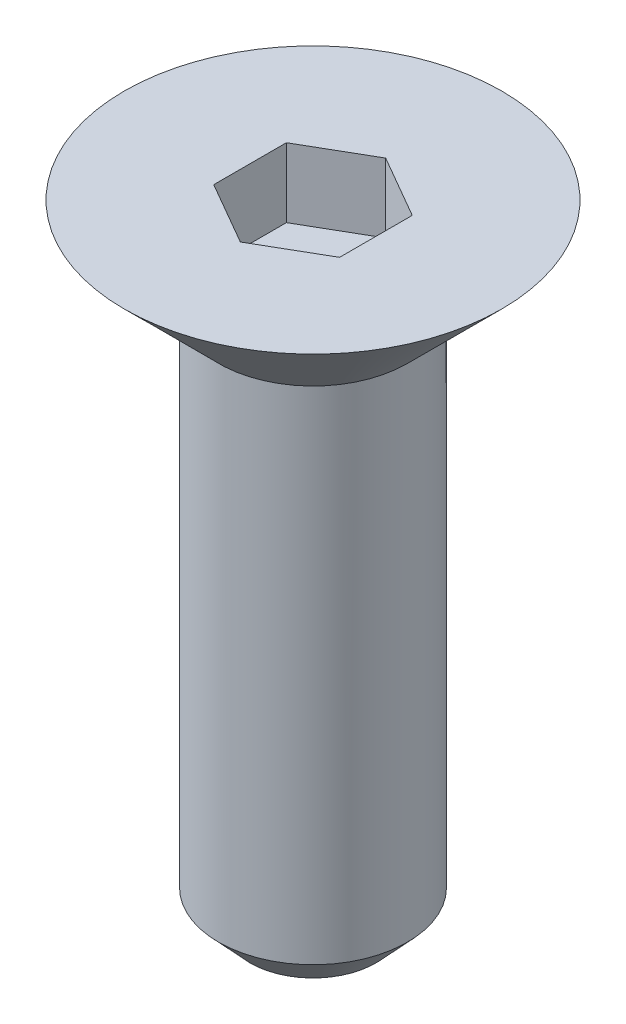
ISO-10303-21;
HEADER;
FILE_DESCRIPTION(('STEP AP214'),'2;1');
FILE_NAME('part.step','',(''),(''),'','','');
FILE_SCHEMA(('AUTOMOTIVE_DESIGN { 1 0 10303 214 1 1 1 1 }'));
ENDSEC;
DATA;
#1=APPLICATION_CONTEXT('core data for automotive mechanical design processes');
#2=APPLICATION_PROTOCOL_DEFINITION('international standard','automotive_design',2000,#1);
#3=PRODUCT_CONTEXT('',#1,'mechanical');
#4=PRODUCT('Part','Part','',(#3));
#5=PRODUCT_RELATED_PRODUCT_CATEGORY('part','',(#4));
#6=PRODUCT_DEFINITION_FORMATION('','',#4);
#7=PRODUCT_DEFINITION_CONTEXT('part definition',#1,'design');
#8=PRODUCT_DEFINITION('design','',#6,#7);
#9=PRODUCT_DEFINITION_SHAPE('','',#8);
#10=(LENGTH_UNIT() NAMED_UNIT(*) SI_UNIT(.MILLI.,.METRE.));
#11=(NAMED_UNIT(*) PLANE_ANGLE_UNIT() SI_UNIT($,.RADIAN.));
#12=(NAMED_UNIT(*) SI_UNIT($,.STERADIAN.) SOLID_ANGLE_UNIT());
#13=UNCERTAINTY_MEASURE_WITH_UNIT(LENGTH_MEASURE(1.E-05),#10,'distance_accuracy_value','');
#14=(GEOMETRIC_REPRESENTATION_CONTEXT(3) GLOBAL_UNCERTAINTY_ASSIGNED_CONTEXT((#13)) GLOBAL_UNIT_ASSIGNED_CONTEXT((#10,
#11,#12)) REPRESENTATION_CONTEXT('',''));
#15=CARTESIAN_POINT('',(0.,0.,0.));
#16=DIRECTION('',(0.,0.,1.));
#17=DIRECTION('',(1.,0.,0.));
#18=AXIS2_PLACEMENT_3D('',#15,#16,#17);
#19=CARTESIAN_POINT('',(0.,-1.10000000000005,1.15470053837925));
#20=DIRECTION('',(0.,-1.,0.));
#21=DIRECTION('',(1.,0.,0.));
#22=AXIS2_PLACEMENT_3D('',#19,#20,#21);
#23=PLANE('',#22);
#24=DIRECTION('',(0.,0.,1.));
#25=VECTOR('',#24,1.);
#26=CARTESIAN_POINT('',(0.999999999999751,-1.10000000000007,-0.577350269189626));
#27=LINE('',#26,#25);
#28=CARTESIAN_POINT('',(0.999999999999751,-1.10000000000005,0.577350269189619));
#29=VERTEX_POINT('',#28);
#30=CARTESIAN_POINT('',(0.999999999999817,-1.10000000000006,-0.577350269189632));
#31=VERTEX_POINT('',#30);
#32=EDGE_CURVE('E121',#29,#31,#27,.F.);
#33=ORIENTED_EDGE('',*,*,#32,.T.);
#34=DIRECTION('',(-0.866025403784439,0.,-0.499999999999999));
#35=VECTOR('',#34,1.);
#36=CARTESIAN_POINT('',(0.,-1.10000000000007,-1.15470053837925));
#37=LINE('',#36,#35);
#38=CARTESIAN_POINT('',(0.,-1.10000000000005,-1.15470053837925));
#39=VERTEX_POINT('',#38);
#40=EDGE_CURVE('E126',#31,#39,#37,.T.);
#41=ORIENTED_EDGE('',*,*,#40,.T.);
#42=DIRECTION('',(-0.866025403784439,0.,0.499999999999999));
#43=VECTOR('',#42,1.);
#44=CARTESIAN_POINT('',(-0.999999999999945,-1.10000000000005,-0.577350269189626));
#45=LINE('',#44,#43);
#46=CARTESIAN_POINT('',(-0.999999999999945,-1.10000000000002,-0.577350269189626));
#47=VERTEX_POINT('',#46);
#48=EDGE_CURVE('E130',#39,#47,#45,.T.);
#49=ORIENTED_EDGE('',*,*,#48,.T.);
#50=DIRECTION('',(0.,0.,1.));
#51=VECTOR('',#50,1.);
#52=CARTESIAN_POINT('',(-0.999999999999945,-1.09999999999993,0.577350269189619));
#53=LINE('',#52,#51);
#54=CARTESIAN_POINT('',(-1.00000000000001,-1.09999999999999,0.577350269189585));
#55=VERTEX_POINT('',#54);
#56=EDGE_CURVE('E68',#47,#55,#53,.T.);
#57=ORIENTED_EDGE('',*,*,#56,.T.);
#58=DIRECTION('',(0.866025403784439,0.,0.499999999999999));
#59=VECTOR('',#58,1.);
#60=CARTESIAN_POINT('',(0.,-1.09999999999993,1.15470053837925));
#61=LINE('',#60,#59);
#62=CARTESIAN_POINT('',(0.,-1.10000000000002,1.15470053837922));
#63=VERTEX_POINT('',#62);
#64=EDGE_CURVE('E70',#55,#63,#61,.T.);
#65=ORIENTED_EDGE('',*,*,#64,.T.);
#66=DIRECTION('',(0.866025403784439,0.,-0.499999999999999));
#67=VECTOR('',#66,1.);
#68=CARTESIAN_POINT('',(0.999999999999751,-1.10000000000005,0.577350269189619));
#69=LINE('',#68,#67);
#70=EDGE_CURVE('E72',#63,#29,#69,.T.);
#71=ORIENTED_EDGE('',*,*,#70,.T.);
#72=EDGE_LOOP('',(#33,#41,#49,#57,#65,#71));
#73=FACE_BOUND('',#72,.T.);
#74=ADVANCED_FACE('F17',(#73),#23,.F.);
#75=CARTESIAN_POINT('',(0.999999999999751,-1.10000000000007,0.577350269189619));
#76=DIRECTION('',(0.499999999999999,0.,0.866025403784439));
#77=DIRECTION('',(0.866025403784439,0.,-0.499999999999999));
#78=AXIS2_PLACEMENT_3D('',#75,#76,#77);
#79=PLANE('',#78);
#80=DIRECTION('',(0.,1.,0.));
#81=VECTOR('',#80,1.);
#82=CARTESIAN_POINT('',(0.999999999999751,-1.10000000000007,0.577350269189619));
#83=LINE('',#82,#81);
#84=CARTESIAN_POINT('',(0.999999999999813,0.,0.577350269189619));
#85=VERTEX_POINT('',#84);
#86=EDGE_CURVE('E83',#85,#29,#83,.F.);
#87=ORIENTED_EDGE('',*,*,#86,.T.);
#88=ORIENTED_EDGE('',*,*,#70,.F.);
#89=DIRECTION('',(0.,1.,0.));
#90=VECTOR('',#89,1.);
#91=CARTESIAN_POINT('',(0.,-1.10000000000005,1.15470053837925));
#92=LINE('',#91,#90);
#93=CARTESIAN_POINT('',(0.,0.,1.1547005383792));
#94=VERTEX_POINT('',#93);
#95=EDGE_CURVE('E77',#63,#94,#92,.T.);
#96=ORIENTED_EDGE('',*,*,#95,.T.);
#97=DIRECTION('',(-0.866025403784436,0.,0.500000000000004));
#98=VECTOR('',#97,1.);
#99=CARTESIAN_POINT('',(1.,0.,0.577350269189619));
#100=LINE('',#99,#98);
#101=EDGE_CURVE('E118',#85,#94,#100,.T.);
#102=ORIENTED_EDGE('',*,*,#101,.F.);
#103=EDGE_LOOP('',(#87,#88,#96,#102));
#104=FACE_BOUND('',#103,.T.);
#105=ADVANCED_FACE('F80',(#104),#79,.F.);
#106=CARTESIAN_POINT('',(0.,-1.10000000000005,1.15470053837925));
#107=DIRECTION('',(-0.499999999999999,0.,0.866025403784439));
#108=DIRECTION('',(0.866025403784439,0.,0.499999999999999));
#109=AXIS2_PLACEMENT_3D('',#106,#107,#108);
#110=PLANE('',#109);
#111=ORIENTED_EDGE('',*,*,#95,.F.);
#112=ORIENTED_EDGE('',*,*,#64,.F.);
#113=DIRECTION('',(0.,-1.,0.));
#114=VECTOR('',#113,1.);
#115=CARTESIAN_POINT('',(-0.999999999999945,-1.09999999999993,0.577350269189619));
#116=LINE('',#115,#114);
#117=CARTESIAN_POINT('',(-1.00000000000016,0.,0.57735026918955));
#118=VERTEX_POINT('',#117);
#119=EDGE_CURVE('E91',#55,#118,#116,.F.);
#120=ORIENTED_EDGE('',*,*,#119,.T.);
#121=DIRECTION('',(-0.866025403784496,0.,-0.4999999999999));
#122=VECTOR('',#121,1.);
#123=CARTESIAN_POINT('',(0.,0.,1.15470053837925));
#124=LINE('',#123,#122);
#125=EDGE_CURVE('E88',#94,#118,#124,.T.);
#126=ORIENTED_EDGE('',*,*,#125,.F.);
#127=EDGE_LOOP('',(#111,#112,#120,#126));
#128=FACE_BOUND('',#127,.T.);
#129=ADVANCED_FACE('F86',(#128),#110,.F.);
#130=CARTESIAN_POINT('',(-0.999999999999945,-1.09999999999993,0.577350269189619));
#131=DIRECTION('',(-1.,0.,0.));
#132=DIRECTION('',(0.,-1.,0.));
#133=AXIS2_PLACEMENT_3D('',#130,#131,#132);
#134=PLANE('',#133);
#135=ORIENTED_EDGE('',*,*,#119,.F.);
#136=ORIENTED_EDGE('',*,*,#56,.F.);
#137=DIRECTION('',(0.,1.,0.));
#138=VECTOR('',#137,1.);
#139=CARTESIAN_POINT('',(-0.999999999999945,-1.09999999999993,-0.577350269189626));
#140=LINE('',#139,#138);
#141=CARTESIAN_POINT('',(-1.00000000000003,0.,-0.577350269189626));
#142=VERTEX_POINT('',#141);
#143=EDGE_CURVE('E128',#47,#142,#140,.T.);
#144=ORIENTED_EDGE('',*,*,#143,.T.);
#145=DIRECTION('',(0.,0.,1.));
#146=VECTOR('',#145,1.);
#147=CARTESIAN_POINT('',(-1.00000000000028,0.,0.));
#148=LINE('',#147,#146);
#149=EDGE_CURVE('E114',#118,#142,#148,.F.);
#150=ORIENTED_EDGE('',*,*,#149,.F.);
#151=EDGE_LOOP('',(#135,#136,#144,#150));
#152=FACE_BOUND('',#151,.T.);
#153=ADVANCED_FACE('F133',(#152),#134,.F.);
#154=CARTESIAN_POINT('',(-0.999999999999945,-1.09999999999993,-0.577350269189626));
#155=DIRECTION('',(-0.499999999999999,0.,-0.866025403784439));
#156=DIRECTION('',(-0.866025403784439,0.,0.499999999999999));
#157=AXIS2_PLACEMENT_3D('',#154,#155,#156);
#158=PLANE('',#157);
#159=ORIENTED_EDGE('',*,*,#143,.F.);
#160=ORIENTED_EDGE('',*,*,#48,.F.);
#161=DIRECTION('',(0.,1.,0.));
#162=VECTOR('',#161,1.);
#163=CARTESIAN_POINT('',(0.,-1.10000000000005,-1.15470053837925));
#164=LINE('',#163,#162);
#165=CARTESIAN_POINT('',(0.,0.,-1.15470053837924));
#166=VERTEX_POINT('',#165);
#167=EDGE_CURVE('E124',#39,#166,#164,.T.);
#168=ORIENTED_EDGE('',*,*,#167,.T.);
#169=DIRECTION('',(0.866025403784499,0.,-0.499999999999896));
#170=VECTOR('',#169,1.);
#171=CARTESIAN_POINT('',(-1.00000000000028,0.,-0.577350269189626));
#172=LINE('',#171,#170);
#173=EDGE_CURVE('E109',#142,#166,#172,.T.);
#174=ORIENTED_EDGE('',*,*,#173,.F.);
#175=EDGE_LOOP('',(#159,#160,#168,#174));
#176=FACE_BOUND('',#175,.T.);
#177=ADVANCED_FACE('F143',(#176),#158,.F.);
#178=CARTESIAN_POINT('',(0.,-1.10000000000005,-1.15470053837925));
#179=DIRECTION('',(0.499999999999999,0.,-0.866025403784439));
#180=DIRECTION('',(-0.866025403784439,0.,-0.499999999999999));
#181=AXIS2_PLACEMENT_3D('',#178,#179,#180);
#182=PLANE('',#181);
#183=ORIENTED_EDGE('',*,*,#167,.F.);
#184=ORIENTED_EDGE('',*,*,#40,.F.);
#185=DIRECTION('',(0.,1.,0.));
#186=VECTOR('',#185,1.);
#187=CARTESIAN_POINT('',(0.999999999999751,-1.10000000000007,-0.577350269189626));
#188=LINE('',#187,#186);
#189=CARTESIAN_POINT('',(0.999999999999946,0.,-0.577350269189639));
#190=VERTEX_POINT('',#189);
#191=EDGE_CURVE('E35',#31,#190,#188,.T.);
#192=ORIENTED_EDGE('',*,*,#191,.T.);
#193=DIRECTION('',(0.866025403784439,0.,0.5));
#194=VECTOR('',#193,1.);
#195=CARTESIAN_POINT('',(0.,0.,-1.15470053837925));
#196=LINE('',#195,#194);
#197=EDGE_CURVE('E105',#166,#190,#196,.T.);
#198=ORIENTED_EDGE('',*,*,#197,.F.);
#199=EDGE_LOOP('',(#183,#184,#192,#198));
#200=FACE_BOUND('',#199,.T.);
#201=ADVANCED_FACE('F141',(#200),#182,.F.);
#202=CARTESIAN_POINT('',(0.999999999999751,-1.10000000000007,-0.577350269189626));
#203=DIRECTION('',(1.,0.,0.));
#204=DIRECTION('',(0.,1.,0.));
#205=AXIS2_PLACEMENT_3D('',#202,#203,#204);
#206=PLANE('',#205);
#207=ORIENTED_EDGE('',*,*,#191,.F.);
#208=ORIENTED_EDGE('',*,*,#32,.F.);
#209=ORIENTED_EDGE('',*,*,#86,.F.);
#210=DIRECTION('',(0.,0.,1.));
#211=VECTOR('',#210,1.);
#212=CARTESIAN_POINT('',(1.,0.,0.));
#213=LINE('',#212,#211);
#214=EDGE_CURVE('E101',#190,#85,#213,.T.);
#215=ORIENTED_EDGE('',*,*,#214,.F.);
#216=EDGE_LOOP('',(#207,#208,#209,#215));
#217=FACE_BOUND('',#216,.T.);
#218=ADVANCED_FACE('F138',(#217),#206,.F.);
#219=CARTESIAN_POINT('',(0.,-10.0000000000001,0.));
#220=DIRECTION('',(0.,1.,0.));
#221=DIRECTION('',(-1.,0.,0.));
#222=AXIS2_PLACEMENT_3D('',#219,#220,#221);
#223=PLANE('',#222);
#224=CARTESIAN_POINT('',(0.,-10.0000000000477,0.));
#225=DIRECTION('',(0.,1.,0.));
#226=DIRECTION('',(0.,0.,1.));
#227=AXIS2_PLACEMENT_3D('',#224,#225,#226);
#228=CIRCLE('',#227,1.0000000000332);
#229=CARTESIAN_POINT('',(0.,-10.0000000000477,1.0000000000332));
#230=VERTEX_POINT('',#229);
#231=EDGE_CURVE('E20',#230,#230,#228,.T.);
#232=ORIENTED_EDGE('',*,*,#231,.F.);
#233=EDGE_LOOP('',(#232));
#234=FACE_BOUND('',#233,.T.);
#235=ADVANCED_FACE('F170',(#234),#223,.F.);
#236=CARTESIAN_POINT('',(0.,0.,0.));
#237=DIRECTION('',(0.,1.,0.));
#238=DIRECTION('',(-1.,0.,0.));
#239=AXIS2_PLACEMENT_3D('',#236,#237,#238);
#240=PLANE('',#239);
#241=CARTESIAN_POINT('',(0.,-5.68434188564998E-11,0.));
#242=DIRECTION('',(0.,1.,0.));
#243=DIRECTION('',(-1.,0.,0.));
#244=AXIS2_PLACEMENT_3D('',#241,#242,#243);
#245=CIRCLE('',#244,2.9999999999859);
#246=CARTESIAN_POINT('',(-2.9999999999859,-5.68435437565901E-11,0.));
#247=VERTEX_POINT('',#246);
#248=EDGE_CURVE('E94',#247,#247,#245,.F.);
#249=ORIENTED_EDGE('',*,*,#248,.F.);
#250=EDGE_LOOP('',(#249));
#251=FACE_BOUND('',#250,.T.);
#252=ORIENTED_EDGE('',*,*,#197,.T.);
#253=ORIENTED_EDGE('',*,*,#214,.T.);
#254=ORIENTED_EDGE('',*,*,#101,.T.);
#255=ORIENTED_EDGE('',*,*,#125,.T.);
#256=ORIENTED_EDGE('',*,*,#149,.T.);
#257=ORIENTED_EDGE('',*,*,#173,.T.);
#258=EDGE_LOOP('',(#252,#253,#254,#255,#256,#257));
#259=FACE_BOUND('',#258,.T.);
#260=ADVANCED_FACE('F136',(#251,#259),#240,.T.);
#261=CARTESIAN_POINT('',(0.,-9.46381564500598,0.));
#262=DIRECTION('',(0.,1.,0.));
#263=DIRECTION('',(0.,0.,1.));
#264=AXIS2_PLACEMENT_3D('',#261,#262,#263);
#265=CONICAL_SURFACE('',#264,1.50000000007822,0.750491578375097);
#266=CARTESIAN_POINT('',(0.,-9.46381564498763,0.));
#267=DIRECTION('',(0.,1.,0.));
#268=DIRECTION('',(-1.,0.,0.));
#269=AXIS2_PLACEMENT_3D('',#266,#267,#268);
#270=CIRCLE('',#269,1.5);
#271=CARTESIAN_POINT('',(-1.49999999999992,-9.46381564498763,0.));
#272=VERTEX_POINT('',#271);
#273=EDGE_CURVE('E26',#272,#272,#270,.T.);
#274=ORIENTED_EDGE('',*,*,#273,.F.);
#275=EDGE_LOOP('',(#274));
#276=FACE_BOUND('',#275,.T.);
#277=ORIENTED_EDGE('',*,*,#231,.T.);
#278=EDGE_LOOP('',(#277));
#279=FACE_BOUND('',#278,.T.);
#280=ADVANCED_FACE('F161',(#276,#279),#265,.T.);
#281=CARTESIAN_POINT('',(0.,5.6843418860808E-11,0.));
#282=DIRECTION('',(0.,1.,0.));
#283=DIRECTION('',(-1.,0.,0.));
#284=AXIS2_PLACEMENT_3D('',#281,#282,#283);
#285=CONICAL_SURFACE('',#284,3.00000000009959,0.785398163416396);
#286=ORIENTED_EDGE('',*,*,#248,.T.);
#287=EDGE_LOOP('',(#286));
#288=FACE_BOUND('',#287,.T.);
#289=CARTESIAN_POINT('',(0.,-1.50000000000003,0.));
#290=DIRECTION('',(0.,1.,0.));
#291=DIRECTION('',(-1.,0.,0.));
#292=AXIS2_PLACEMENT_3D('',#289,#290,#291);
#293=CIRCLE('',#292,1.5);
#294=CARTESIAN_POINT('',(-1.49999999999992,-1.50000000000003,0.));
#295=VERTEX_POINT('',#294);
#296=EDGE_CURVE('E11',#295,#295,#293,.F.);
#297=ORIENTED_EDGE('',*,*,#296,.F.);
#298=EDGE_LOOP('',(#297));
#299=FACE_BOUND('',#298,.T.);
#300=ADVANCED_FACE('F155',(#288,#299),#285,.T.);
#301=CARTESIAN_POINT('',(0.,-10.0000000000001,0.));
#302=DIRECTION('',(0.,1.,0.));
#303=DIRECTION('',(-1.,0.,0.));
#304=AXIS2_PLACEMENT_3D('',#301,#302,#303);
#305=CYLINDRICAL_SURFACE('',#304,1.5);
#306=ORIENTED_EDGE('',*,*,#296,.T.);
#307=EDGE_LOOP('',(#306));
#308=FACE_BOUND('',#307,.T.);
#309=ORIENTED_EDGE('',*,*,#273,.T.);
#310=EDGE_LOOP('',(#309));
#311=FACE_BOUND('',#310,.T.);
#312=ADVANCED_FACE('F153',(#308,#311),#305,.T.);
#313=CLOSED_SHELL('',(#74,#105,#129,#153,#177,#201,#218,#235,#260,#280,#300,#312));
#314=MANIFOLD_SOLID_BREP('B1',#313);
#315=ADVANCED_BREP_SHAPE_REPRESENTATION('',(#18,#314),#14);
#316=SHAPE_DEFINITION_REPRESENTATION(#9,#315);
ENDSEC;
END-ISO-10303-21;
